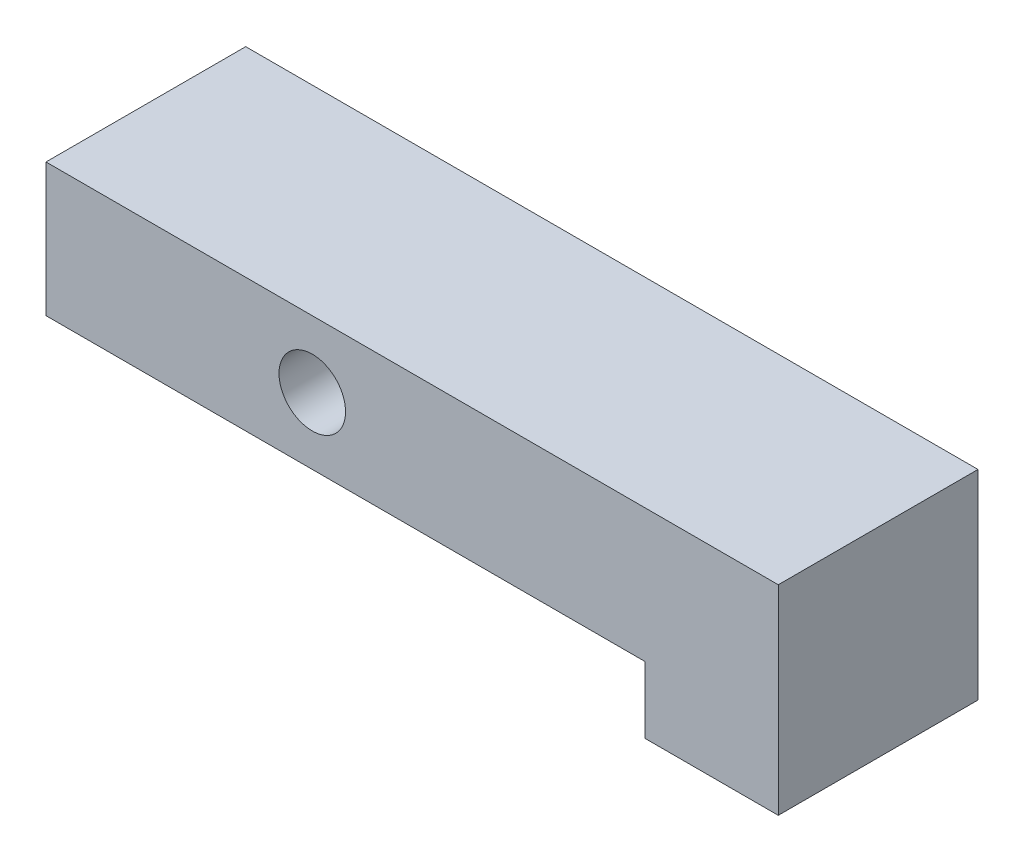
from build123d import *

# Parameters (mm, degrees)
SKETCH1_R           = 3.175
BOSS_EXTRUDE1_DEPTH = 19.05


with BuildPart() as part:
    # Sketch1 → Boss-Extrude1 (new body)
    with BuildSketch(Plane.XY):
        Polygon((44.45, 6.35), (0, 6.35), (-25.4, 6.35), (-25.4, -6.35), (31.75, -6.35), (31.75, -12.7), (44.45, -12.7), align=None)
        with Locations(Location((0, 0, 0), (0, 0, 180))):
            Circle(SKETCH1_R, mode=Mode.SUBTRACT)
    extrude(amount=BOSS_EXTRUDE1_DEPTH)


solid = part.part
